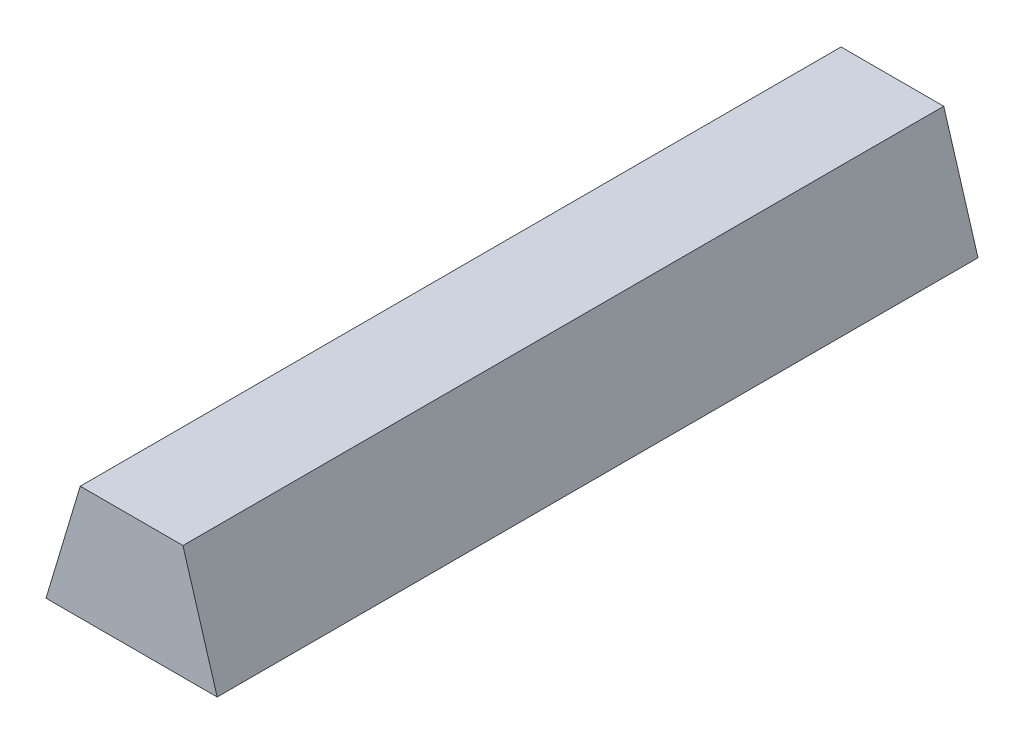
ISO-10303-21;
HEADER;
FILE_DESCRIPTION(('STEP AP214'),'2;1');
FILE_NAME('part.step','',(''),(''),'','','');
FILE_SCHEMA(('AUTOMOTIVE_DESIGN { 1 0 10303 214 1 1 1 1 }'));
ENDSEC;
DATA;
#1=APPLICATION_CONTEXT('core data for automotive mechanical design processes');
#2=APPLICATION_PROTOCOL_DEFINITION('international standard','automotive_design',2000,#1);
#3=PRODUCT_CONTEXT('',#1,'mechanical');
#4=PRODUCT('Part','Part','',(#3));
#5=PRODUCT_RELATED_PRODUCT_CATEGORY('part','',(#4));
#6=PRODUCT_DEFINITION_FORMATION('','',#4);
#7=PRODUCT_DEFINITION_CONTEXT('part definition',#1,'design');
#8=PRODUCT_DEFINITION('design','',#6,#7);
#9=PRODUCT_DEFINITION_SHAPE('','',#8);
#10=(LENGTH_UNIT() NAMED_UNIT(*) SI_UNIT(.MILLI.,.METRE.));
#11=(NAMED_UNIT(*) PLANE_ANGLE_UNIT() SI_UNIT($,.RADIAN.));
#12=(NAMED_UNIT(*) SI_UNIT($,.STERADIAN.) SOLID_ANGLE_UNIT());
#13=UNCERTAINTY_MEASURE_WITH_UNIT(LENGTH_MEASURE(1.E-05),#10,'distance_accuracy_value','');
#14=(GEOMETRIC_REPRESENTATION_CONTEXT(3) GLOBAL_UNCERTAINTY_ASSIGNED_CONTEXT((#13)) GLOBAL_UNIT_ASSIGNED_CONTEXT((#10,
#11,#12)) REPRESENTATION_CONTEXT('',''));
#15=CARTESIAN_POINT('',(0.,0.,0.));
#16=DIRECTION('',(0.,0.,1.));
#17=DIRECTION('',(1.,0.,0.));
#18=AXIS2_PLACEMENT_3D('',#15,#16,#17);
#19=CARTESIAN_POINT('',(165.137614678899,49.5412844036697,2000.));
#20=DIRECTION('',(0.957826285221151,0.287347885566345,0.));
#21=DIRECTION('',(-0.287347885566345,0.957826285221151,0.));
#22=AXIS2_PLACEMENT_3D('',#19,#20,#21);
#23=PLANE('',#22);
#24=DIRECTION('',(0.287347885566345,-0.957826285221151,0.));
#25=VECTOR('',#24,1.);
#26=CARTESIAN_POINT('',(165.137614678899,49.5412844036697,0.));
#27=LINE('',#26,#25);
#28=CARTESIAN_POINT('',(135.,150.,0.));
#29=VERTEX_POINT('',#28);
#30=CARTESIAN_POINT('',(225.,-150.,0.));
#31=VERTEX_POINT('',#30);
#32=EDGE_CURVE('E99',#29,#31,#27,.T.);
#33=ORIENTED_EDGE('',*,*,#32,.F.);
#34=DIRECTION('',(0.,0.,-1.));
#35=VECTOR('',#34,1.);
#36=CARTESIAN_POINT('',(135.,150.,2000.));
#37=LINE('',#36,#35);
#38=CARTESIAN_POINT('',(135.,150.,2000.));
#39=VERTEX_POINT('',#38);
#40=EDGE_CURVE('E11',#39,#29,#37,.T.);
#41=ORIENTED_EDGE('',*,*,#40,.F.);
#42=DIRECTION('',(0.287347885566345,-0.957826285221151,0.));
#43=VECTOR('',#42,1.);
#44=CARTESIAN_POINT('',(165.137614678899,49.5412844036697,2000.));
#45=LINE('',#44,#43);
#46=CARTESIAN_POINT('',(225.,-150.,2000.));
#47=VERTEX_POINT('',#46);
#48=EDGE_CURVE('E93',#39,#47,#45,.T.);
#49=ORIENTED_EDGE('',*,*,#48,.T.);
#50=DIRECTION('',(0.,0.,-1.));
#51=VECTOR('',#50,1.);
#52=CARTESIAN_POINT('',(225.,-150.,2000.));
#53=LINE('',#52,#51);
#54=EDGE_CURVE('E74',#47,#31,#53,.T.);
#55=ORIENTED_EDGE('',*,*,#54,.T.);
#56=EDGE_LOOP('',(#33,#41,#49,#55));
#57=FACE_BOUND('',#56,.T.);
#58=ADVANCED_FACE('F36',(#57),#23,.T.);
#59=CARTESIAN_POINT('',(0.,150.,2000.));
#60=DIRECTION('',(0.,1.,0.));
#61=DIRECTION('',(0.,0.,1.));
#62=AXIS2_PLACEMENT_3D('',#59,#60,#61);
#63=PLANE('',#62);
#64=DIRECTION('',(1.,0.,0.));
#65=VECTOR('',#64,1.);
#66=CARTESIAN_POINT('',(0.,150.,0.));
#67=LINE('',#66,#65);
#68=CARTESIAN_POINT('',(-135.,150.,0.));
#69=VERTEX_POINT('',#68);
#70=EDGE_CURVE('E87',#69,#29,#67,.T.);
#71=ORIENTED_EDGE('',*,*,#70,.F.);
#72=DIRECTION('',(0.,0.,-1.));
#73=VECTOR('',#72,1.);
#74=CARTESIAN_POINT('',(-135.,150.,2000.));
#75=LINE('',#74,#73);
#76=CARTESIAN_POINT('',(-135.,150.,2000.));
#77=VERTEX_POINT('',#76);
#78=EDGE_CURVE('E44',#77,#69,#75,.T.);
#79=ORIENTED_EDGE('',*,*,#78,.F.);
#80=DIRECTION('',(1.,0.,0.));
#81=VECTOR('',#80,1.);
#82=CARTESIAN_POINT('',(0.,150.,2000.));
#83=LINE('',#82,#81);
#84=EDGE_CURVE('E85',#77,#39,#83,.T.);
#85=ORIENTED_EDGE('',*,*,#84,.T.);
#86=ORIENTED_EDGE('',*,*,#40,.T.);
#87=EDGE_LOOP('',(#71,#79,#85,#86));
#88=FACE_BOUND('',#87,.T.);
#89=ADVANCED_FACE('F83',(#88),#63,.T.);
#90=CARTESIAN_POINT('',(-165.137614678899,49.5412844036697,2000.));
#91=DIRECTION('',(0.957826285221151,-0.287347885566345,0.));
#92=DIRECTION('',(0.287347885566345,0.957826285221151,0.));
#93=AXIS2_PLACEMENT_3D('',#90,#91,#92);
#94=PLANE('',#93);
#95=DIRECTION('',(-0.287347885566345,-0.957826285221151,0.));
#96=VECTOR('',#95,1.);
#97=CARTESIAN_POINT('',(-165.137614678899,49.5412844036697,0.));
#98=LINE('',#97,#96);
#99=CARTESIAN_POINT('',(-225.,-150.,0.));
#100=VERTEX_POINT('',#99);
#101=EDGE_CURVE('E67',#69,#100,#98,.T.);
#102=ORIENTED_EDGE('',*,*,#101,.T.);
#103=DIRECTION('',(0.,0.,-1.));
#104=VECTOR('',#103,1.);
#105=CARTESIAN_POINT('',(-225.,-150.,2000.));
#106=LINE('',#105,#104);
#107=CARTESIAN_POINT('',(-225.,-150.,2000.));
#108=VERTEX_POINT('',#107);
#109=EDGE_CURVE('E88',#108,#100,#106,.T.);
#110=ORIENTED_EDGE('',*,*,#109,.F.);
#111=DIRECTION('',(-0.287347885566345,-0.957826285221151,0.));
#112=VECTOR('',#111,1.);
#113=CARTESIAN_POINT('',(-165.137614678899,49.5412844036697,2000.));
#114=LINE('',#113,#112);
#115=EDGE_CURVE('E89',#77,#108,#114,.T.);
#116=ORIENTED_EDGE('',*,*,#115,.F.);
#117=ORIENTED_EDGE('',*,*,#78,.T.);
#118=EDGE_LOOP('',(#102,#110,#116,#117));
#119=FACE_BOUND('',#118,.T.);
#120=ADVANCED_FACE('F90',(#119),#94,.F.);
#121=CARTESIAN_POINT('',(0.,-150.,2000.));
#122=DIRECTION('',(0.,1.,0.));
#123=DIRECTION('',(0.,0.,1.));
#124=AXIS2_PLACEMENT_3D('',#121,#122,#123);
#125=PLANE('',#124);
#126=DIRECTION('',(1.,0.,0.));
#127=VECTOR('',#126,1.);
#128=CARTESIAN_POINT('',(0.,-150.,0.));
#129=LINE('',#128,#127);
#130=EDGE_CURVE('E95',#100,#31,#129,.T.);
#131=ORIENTED_EDGE('',*,*,#130,.T.);
#132=ORIENTED_EDGE('',*,*,#54,.F.);
#133=DIRECTION('',(1.,0.,0.));
#134=VECTOR('',#133,1.);
#135=CARTESIAN_POINT('',(0.,-150.,2000.));
#136=LINE('',#135,#134);
#137=EDGE_CURVE('E52',#108,#47,#136,.T.);
#138=ORIENTED_EDGE('',*,*,#137,.F.);
#139=ORIENTED_EDGE('',*,*,#109,.T.);
#140=EDGE_LOOP('',(#131,#132,#138,#139));
#141=FACE_BOUND('',#140,.T.);
#142=ADVANCED_FACE('F108',(#141),#125,.F.);
#143=CARTESIAN_POINT('',(0.,0.,2000.));
#144=DIRECTION('',(0.,0.,1.));
#145=DIRECTION('',(1.,0.,0.));
#146=AXIS2_PLACEMENT_3D('',#143,#144,#145);
#147=PLANE('',#146);
#148=ORIENTED_EDGE('',*,*,#48,.F.);
#149=ORIENTED_EDGE('',*,*,#84,.F.);
#150=ORIENTED_EDGE('',*,*,#115,.T.);
#151=ORIENTED_EDGE('',*,*,#137,.T.);
#152=EDGE_LOOP('',(#148,#149,#150,#151));
#153=FACE_BOUND('',#152,.T.);
#154=ADVANCED_FACE('F92',(#153),#147,.T.);
#155=CARTESIAN_POINT('',(0.,0.,0.));
#156=DIRECTION('',(0.,0.,1.));
#157=DIRECTION('',(1.,0.,0.));
#158=AXIS2_PLACEMENT_3D('',#155,#156,#157);
#159=PLANE('',#158);
#160=ORIENTED_EDGE('',*,*,#32,.T.);
#161=ORIENTED_EDGE('',*,*,#130,.F.);
#162=ORIENTED_EDGE('',*,*,#101,.F.);
#163=ORIENTED_EDGE('',*,*,#70,.T.);
#164=EDGE_LOOP('',(#160,#161,#162,#163));
#165=FACE_BOUND('',#164,.T.);
#166=ADVANCED_FACE('F110',(#165),#159,.F.);
#167=CLOSED_SHELL('',(#58,#89,#120,#142,#154,#166));
#168=MANIFOLD_SOLID_BREP('B2',#167);
#169=ADVANCED_BREP_SHAPE_REPRESENTATION('',(#18,#168),#14);
#170=SHAPE_DEFINITION_REPRESENTATION(#9,#169);
ENDSEC;
END-ISO-10303-21;
